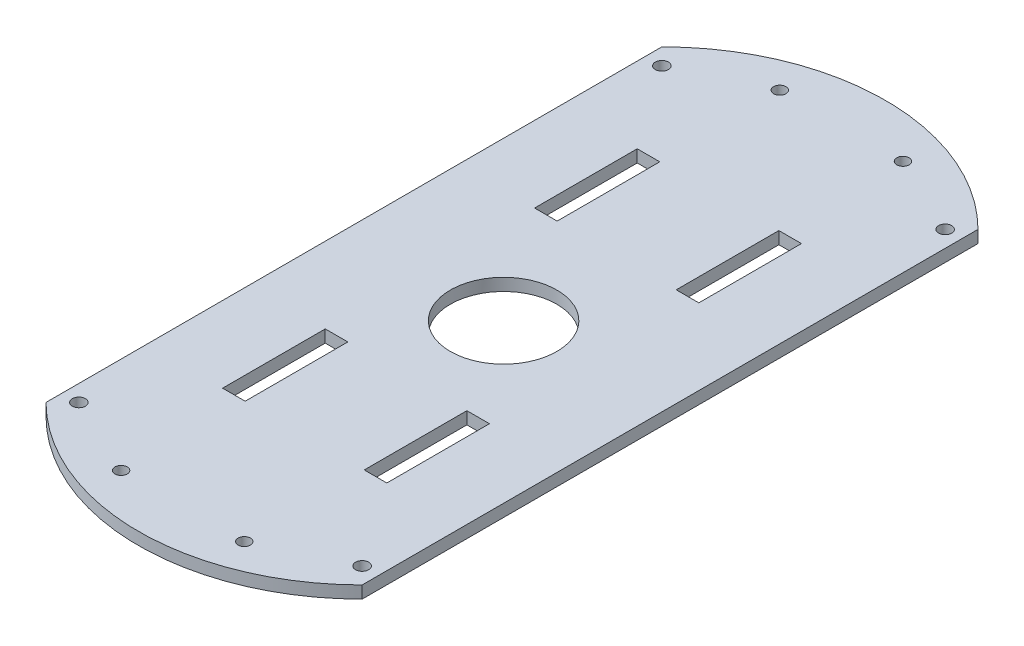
from build123d import *

# Parameters (mm, degrees)
BOSS_EXTRUDE2_DEPTH = 3
SKETCH4_R           = 12.967360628
SKETCH4_R_2         = 1.6
SKETCH4_R_3         = 1.5
SKETCH4_W           = 5.5
SKETCH4_H           = 25
CUT_EXTRUDE1_DEPTH  = 101.72
SKETCH9_W           = 5.5
SKETCH9_H           = 25
BOSS_EXTRUDE4_DEPTH = 3
SKETCH11_W          = 5.5
SKETCH11_H          = 25
CUT_EXTRUDE3_DEPTH  = 3


with BuildPart() as part:
    # Sketch1 → Boss-Extrude2 (new body)
    with BuildSketch(Plane(origin=(0, 0, 0), x_dir=(1, 0, 0), z_dir=(0, 1, 0))):
        with BuildLine():
            Line((0, 0), (0, -150))
            ThreePointArc((0, -150), (38.5, -165.947222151), (77, -150))
            Line((77, -150), (77, 0))
            ThreePointArc((77, 0), (38.5, 15.947222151), (0, 0))
        make_face()
    extrude(amount=BOSS_EXTRUDE2_DEPTH)

    # Sketch4 → Cut-Extrude1 (cut)
    with BuildSketch(Plane(origin=(0, 3, 0), x_dir=(1, 0, 0), z_dir=(0, 1, 0))):
        with Locations(Location((38.5, -77.047524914, 0), (0, 0, 270))):
            Circle(SKETCH4_R)
        with Locations(Location((4, -4, 0), (0, 0, 270))):
            Circle(SKETCH4_R_2)
        with Locations(Location((73, -4, 0), (0, 0, 270))):
            Circle(SKETCH4_R_2)
        with Locations(Location((4, -146, 0), (0, 0, 270))):
            Circle(SKETCH4_R_2)
        with Locations(Location((73, -146, 0), (0, 0, 270))):
            Circle(SKETCH4_R_2)
        with Locations(Location((23.5, 5.218, 0), (0, 0, 270))):
            Circle(SKETCH4_R_3)
        with Locations(Location((53.5, 5.218, 0), (0, 0, 270))):
            Circle(SKETCH4_R_3)
        with Locations(Location((23.5, -155.208, 0), (0, 0, 270))):
            Circle(SKETCH4_R_3)
        with Locations(Location((53.5, -155.208, 0), (0, 0, 270))):
            Circle(SKETCH4_R_3)
        with Locations((21.25, -37)):
            Rectangle(SKETCH4_W, SKETCH4_H)
        with Locations((55.75, -37)):
            Rectangle(SKETCH4_W, SKETCH4_H)
        with Locations((21.25, -112.99)):
            Rectangle(SKETCH4_W, SKETCH4_H)
        with Locations((58.474925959, -112.99)):
            Rectangle(SKETCH4_W, SKETCH4_H)
    extrude(amount=-CUT_EXTRUDE1_DEPTH, mode=Mode.SUBTRACT)

    # Sketch9 → Boss-Extrude4 (add)
    with BuildSketch(Plane(origin=(0, 3, 0), x_dir=(1, 0, 0), z_dir=(0, 1, 0))):
        with Locations((58.474925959, -112.99)):
            Rectangle(SKETCH9_W, SKETCH9_H)
    extrude(amount=-BOSS_EXTRUDE4_DEPTH)

    # Sketch11 → Cut-Extrude3 (cut)
    with BuildSketch(Plane(origin=(0, 3, 0), x_dir=(1, 0, 0), z_dir=(0, 1, 0))):
        with Locations((55.75, -112.99)):
            Rectangle(SKETCH11_W, SKETCH11_H)
    extrude(amount=-CUT_EXTRUDE3_DEPTH, mode=Mode.SUBTRACT)


solid = part.part
